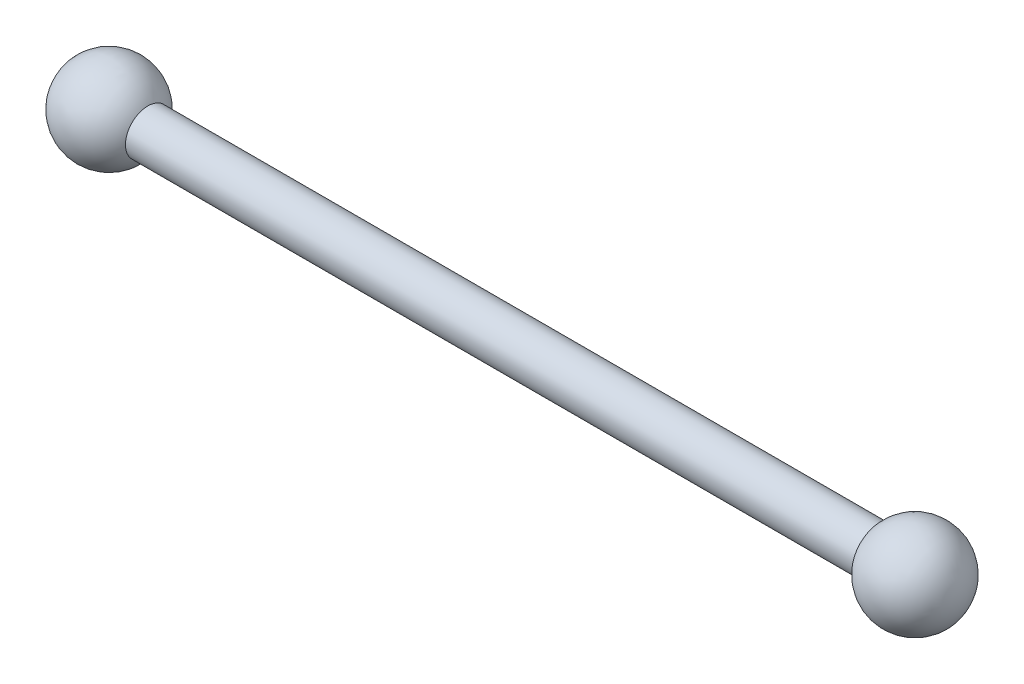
ISO-10303-21;
HEADER;
FILE_DESCRIPTION(('STEP AP214'),'2;1');
FILE_NAME('part.step','',(''),(''),'','','');
FILE_SCHEMA(('AUTOMOTIVE_DESIGN { 1 0 10303 214 1 1 1 1 }'));
ENDSEC;
DATA;
#1=APPLICATION_CONTEXT('core data for automotive mechanical design processes');
#2=APPLICATION_PROTOCOL_DEFINITION('international standard','automotive_design',2000,#1);
#3=PRODUCT_CONTEXT('',#1,'mechanical');
#4=PRODUCT('Part','Part','',(#3));
#5=PRODUCT_RELATED_PRODUCT_CATEGORY('part','',(#4));
#6=PRODUCT_DEFINITION_FORMATION('','',#4);
#7=PRODUCT_DEFINITION_CONTEXT('part definition',#1,'design');
#8=PRODUCT_DEFINITION('design','',#6,#7);
#9=PRODUCT_DEFINITION_SHAPE('','',#8);
#10=(LENGTH_UNIT() NAMED_UNIT(*) SI_UNIT(.MILLI.,.METRE.));
#11=(NAMED_UNIT(*) PLANE_ANGLE_UNIT() SI_UNIT($,.RADIAN.));
#12=(NAMED_UNIT(*) SI_UNIT($,.STERADIAN.) SOLID_ANGLE_UNIT());
#13=UNCERTAINTY_MEASURE_WITH_UNIT(LENGTH_MEASURE(1.E-05),#10,'distance_accuracy_value','');
#14=(GEOMETRIC_REPRESENTATION_CONTEXT(3) GLOBAL_UNCERTAINTY_ASSIGNED_CONTEXT((#13)) GLOBAL_UNIT_ASSIGNED_CONTEXT((#10,
#11,#12)) REPRESENTATION_CONTEXT('',''));
#15=CARTESIAN_POINT('',(0.,0.,0.));
#16=DIRECTION('',(0.,0.,1.));
#17=DIRECTION('',(1.,0.,0.));
#18=AXIS2_PLACEMENT_3D('',#15,#16,#17);
#19=CARTESIAN_POINT('',(-167.400599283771,127.905922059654,0.));
#20=DIRECTION('',(1.,0.,0.));
#21=DIRECTION('',(0.,1.,0.));
#22=AXIS2_PLACEMENT_3D('',#19,#20,#21);
#23=SPHERICAL_SURFACE('',#22,10.);
#24=CARTESIAN_POINT('',(-158.740345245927,127.905922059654,0.));
#25=DIRECTION('',(1.,0.,0.));
#26=DIRECTION('',(0.,0.,-1.));
#27=AXIS2_PLACEMENT_3D('',#24,#25,#26);
#28=CIRCLE('',#27,5.);
#29=CARTESIAN_POINT('',(-158.740345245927,127.905922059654,-5.));
#30=VERTEX_POINT('',#29);
#31=EDGE_CURVE('E36',#30,#30,#28,.T.);
#32=ORIENTED_EDGE('',*,*,#31,.F.);
#33=EDGE_LOOP('',(#32));
#34=FACE_BOUND('',#33,.T.);
#35=ADVANCED_FACE('F30',(#34),#23,.T.);
#36=CARTESIAN_POINT('',(12.5994007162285,127.905922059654,0.));
#37=DIRECTION('',(1.,0.,0.));
#38=DIRECTION('',(0.,-1.,0.));
#39=AXIS2_PLACEMENT_3D('',#36,#37,#38);
#40=SPHERICAL_SURFACE('',#39,10.);
#41=CARTESIAN_POINT('',(3.93914667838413,127.905922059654,0.));
#42=DIRECTION('',(1.,0.,0.));
#43=DIRECTION('',(0.,0.,-1.));
#44=AXIS2_PLACEMENT_3D('',#41,#42,#43);
#45=CIRCLE('',#44,5.);
#46=CARTESIAN_POINT('',(3.93914667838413,127.905922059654,-5.));
#47=VERTEX_POINT('',#46);
#48=EDGE_CURVE('E10',#47,#47,#45,.T.);
#49=ORIENTED_EDGE('',*,*,#48,.T.);
#50=EDGE_LOOP('',(#49));
#51=FACE_BOUND('',#50,.T.);
#52=ADVANCED_FACE('F46',(#51),#40,.T.);
#53=CARTESIAN_POINT('',(22.5994007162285,127.905922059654,0.));
#54=DIRECTION('',(1.,0.,0.));
#55=DIRECTION('',(0.,0.,-1.));
#56=AXIS2_PLACEMENT_3D('',#53,#54,#55);
#57=CYLINDRICAL_SURFACE('',#56,5.);
#58=ORIENTED_EDGE('',*,*,#31,.T.);
#59=EDGE_LOOP('',(#58));
#60=FACE_BOUND('',#59,.T.);
#61=ORIENTED_EDGE('',*,*,#48,.F.);
#62=EDGE_LOOP('',(#61));
#63=FACE_BOUND('',#62,.T.);
#64=ADVANCED_FACE('F42',(#60,#63),#57,.T.);
#65=CLOSED_SHELL('',(#35,#52,#64));
#66=MANIFOLD_SOLID_BREP('B2',#65);
#67=ADVANCED_BREP_SHAPE_REPRESENTATION('',(#18,#66),#14);
#68=SHAPE_DEFINITION_REPRESENTATION(#9,#67);
ENDSEC;
END-ISO-10303-21;
